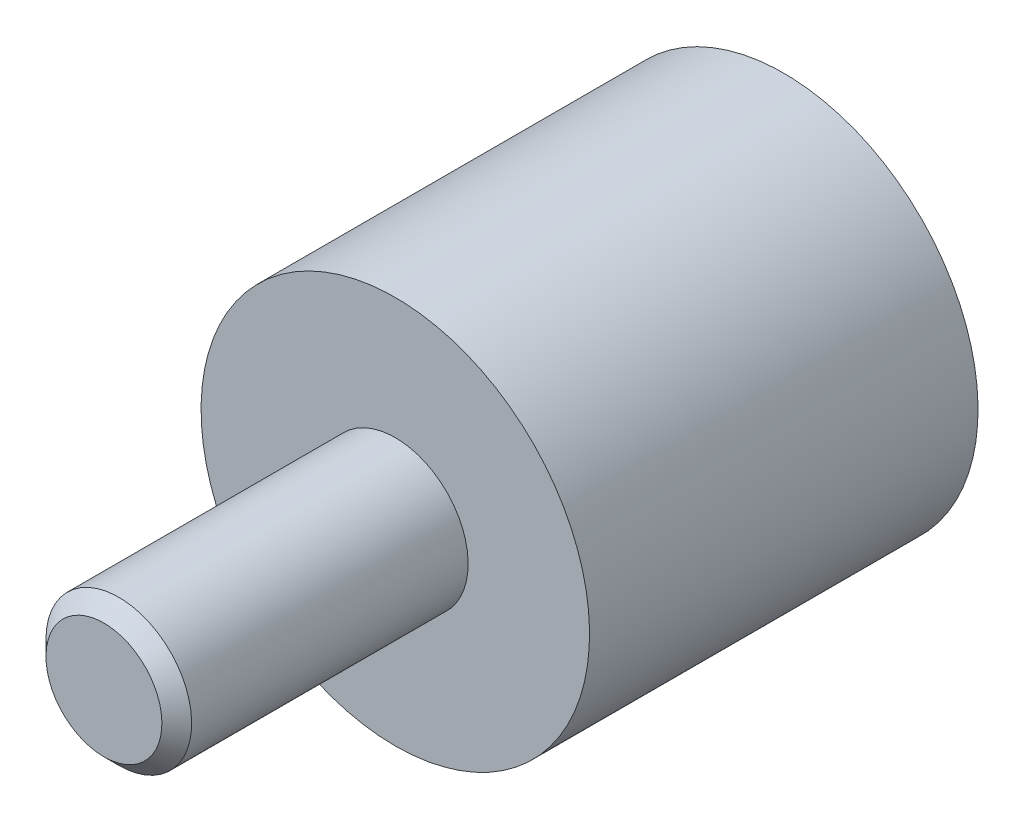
ISO-10303-21;
HEADER;
FILE_DESCRIPTION(('STEP AP214'),'2;1');
FILE_NAME('part.step','',(''),(''),'','','');
FILE_SCHEMA(('AUTOMOTIVE_DESIGN { 1 0 10303 214 1 1 1 1 }'));
ENDSEC;
DATA;
#1=APPLICATION_CONTEXT('core data for automotive mechanical design processes');
#2=APPLICATION_PROTOCOL_DEFINITION('international standard','automotive_design',2000,#1);
#3=PRODUCT_CONTEXT('',#1,'mechanical');
#4=PRODUCT('Part','Part','',(#3));
#5=PRODUCT_RELATED_PRODUCT_CATEGORY('part','',(#4));
#6=PRODUCT_DEFINITION_FORMATION('','',#4);
#7=PRODUCT_DEFINITION_CONTEXT('part definition',#1,'design');
#8=PRODUCT_DEFINITION('design','',#6,#7);
#9=PRODUCT_DEFINITION_SHAPE('','',#8);
#10=(LENGTH_UNIT() NAMED_UNIT(*) SI_UNIT(.MILLI.,.METRE.));
#11=(NAMED_UNIT(*) PLANE_ANGLE_UNIT() SI_UNIT($,.RADIAN.));
#12=(NAMED_UNIT(*) SI_UNIT($,.STERADIAN.) SOLID_ANGLE_UNIT());
#13=UNCERTAINTY_MEASURE_WITH_UNIT(LENGTH_MEASURE(1.E-05),#10,'distance_accuracy_value','');
#14=(GEOMETRIC_REPRESENTATION_CONTEXT(3) GLOBAL_UNCERTAINTY_ASSIGNED_CONTEXT((#13)) GLOBAL_UNIT_ASSIGNED_CONTEXT((#10,
#11,#12)) REPRESENTATION_CONTEXT('',''));
#15=CARTESIAN_POINT('',(0.,0.,0.));
#16=DIRECTION('',(0.,0.,1.));
#17=DIRECTION('',(1.,0.,0.));
#18=AXIS2_PLACEMENT_3D('',#15,#16,#17);
#19=CARTESIAN_POINT('',(3.7333333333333,0.,8.));
#20=DIRECTION('',(0.,0.,1.));
#21=DIRECTION('',(0.,-1.,0.));
#22=AXIS2_PLACEMENT_3D('',#19,#20,#21);
#23=PLANE('',#22);
#24=CARTESIAN_POINT('',(0.,0.,8.));
#25=DIRECTION('',(0.,0.,1.));
#26=DIRECTION('',(0.,-1.,0.));
#27=AXIS2_PLACEMENT_3D('',#24,#25,#26);
#28=CIRCLE('',#27,1.5);
#29=CARTESIAN_POINT('',(0.,-1.5,8.));
#30=VERTEX_POINT('',#29);
#31=EDGE_CURVE('E23',#30,#30,#28,.T.);
#32=ORIENTED_EDGE('',*,*,#31,.F.);
#33=EDGE_LOOP('',(#32));
#34=FACE_BOUND('',#33,.T.);
#35=CARTESIAN_POINT('',(0.,0.,8.));
#36=DIRECTION('',(0.,0.,1.));
#37=DIRECTION('',(0.,-1.,0.));
#38=AXIS2_PLACEMENT_3D('',#35,#36,#37);
#39=CIRCLE('',#38,4.);
#40=CARTESIAN_POINT('',(0.,-4.,8.));
#41=VERTEX_POINT('',#40);
#42=EDGE_CURVE('E27',#41,#41,#39,.T.);
#43=ORIENTED_EDGE('',*,*,#42,.T.);
#44=EDGE_LOOP('',(#43));
#45=FACE_BOUND('',#44,.T.);
#46=ADVANCED_FACE('F12',(#34,#45),#23,.T.);
#47=CARTESIAN_POINT('',(0.,0.,0.26666666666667));
#48=DIRECTION('',(0.,0.,1.));
#49=DIRECTION('',(0.,-1.,0.));
#50=AXIS2_PLACEMENT_3D('',#47,#48,#49);
#51=CYLINDRICAL_SURFACE('',#50,4.);
#52=CARTESIAN_POINT('',(0.,0.,0.));
#53=DIRECTION('',(0.,0.,1.));
#54=DIRECTION('',(0.,-1.,0.));
#55=AXIS2_PLACEMENT_3D('',#52,#53,#54);
#56=CIRCLE('',#55,4.);
#57=CARTESIAN_POINT('',(0.,-4.,0.));
#58=VERTEX_POINT('',#57);
#59=EDGE_CURVE('E32',#58,#58,#56,.T.);
#60=ORIENTED_EDGE('',*,*,#59,.T.);
#61=EDGE_LOOP('',(#60));
#62=FACE_BOUND('',#61,.T.);
#63=ORIENTED_EDGE('',*,*,#42,.F.);
#64=EDGE_LOOP('',(#63));
#65=FACE_BOUND('',#64,.T.);
#66=ADVANCED_FACE('F63',(#62,#65),#51,.T.);
#67=CARTESIAN_POINT('',(4.,0.,0.));
#68=DIRECTION('',(0.,0.,-1.));
#69=DIRECTION('',(0.,1.,0.));
#70=AXIS2_PLACEMENT_3D('',#67,#68,#69);
#71=PLANE('',#70);
#72=CARTESIAN_POINT('',(0.,0.,0.));
#73=DIRECTION('',(0.,0.,-1.));
#74=DIRECTION('',(0.,1.,0.));
#75=AXIS2_PLACEMENT_3D('',#72,#73,#74);
#76=CIRCLE('',#75,1.8);
#77=CARTESIAN_POINT('',(0.,1.8,0.));
#78=VERTEX_POINT('',#77);
#79=EDGE_CURVE('E8',#78,#78,#76,.F.);
#80=ORIENTED_EDGE('',*,*,#79,.T.);
#81=EDGE_LOOP('',(#80));
#82=FACE_BOUND('',#81,.T.);
#83=ORIENTED_EDGE('',*,*,#59,.F.);
#84=EDGE_LOOP('',(#83));
#85=FACE_BOUND('',#84,.T.);
#86=ADVANCED_FACE('F68',(#82,#85),#71,.T.);
#87=CARTESIAN_POINT('',(0.,0.,14.));
#88=DIRECTION('',(0.,0.,1.));
#89=DIRECTION('',(0.,-1.,0.));
#90=AXIS2_PLACEMENT_3D('',#87,#88,#89);
#91=PLANE('',#90);
#92=CARTESIAN_POINT('',(0.,0.,14.));
#93=DIRECTION('',(0.,0.,1.));
#94=DIRECTION('',(0.,-1.,0.));
#95=AXIS2_PLACEMENT_3D('',#92,#93,#94);
#96=CIRCLE('',#95,1.1935);
#97=CARTESIAN_POINT('',(0.,-1.1935,14.));
#98=VERTEX_POINT('',#97);
#99=EDGE_CURVE('E35',#98,#98,#96,.T.);
#100=ORIENTED_EDGE('',*,*,#99,.T.);
#101=EDGE_LOOP('',(#100));
#102=FACE_BOUND('',#101,.T.);
#103=ADVANCED_FACE('F74',(#102),#91,.T.);
#104=CARTESIAN_POINT('',(0.,0.,14.));
#105=DIRECTION('',(0.,0.,-1.));
#106=DIRECTION('',(0.,1.,0.));
#107=AXIS2_PLACEMENT_3D('',#104,#105,#106);
#108=CONICAL_SURFACE('',#107,1.1935,0.785398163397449);
#109=CARTESIAN_POINT('',(0.,0.,13.6935));
#110=DIRECTION('',(0.,0.,1.));
#111=DIRECTION('',(0.,-1.,0.));
#112=AXIS2_PLACEMENT_3D('',#109,#110,#111);
#113=CIRCLE('',#112,1.5);
#114=CARTESIAN_POINT('',(0.,-1.5,13.6935));
#115=VERTEX_POINT('',#114);
#116=EDGE_CURVE('E38',#115,#115,#113,.T.);
#117=ORIENTED_EDGE('',*,*,#116,.T.);
#118=EDGE_LOOP('',(#117));
#119=FACE_BOUND('',#118,.T.);
#120=ORIENTED_EDGE('',*,*,#99,.F.);
#121=EDGE_LOOP('',(#120));
#122=FACE_BOUND('',#121,.T.);
#123=ADVANCED_FACE('F57',(#119,#122),#108,.T.);
#124=CARTESIAN_POINT('',(0.,0.,8.));
#125=DIRECTION('',(0.,0.,1.));
#126=DIRECTION('',(0.,-1.,0.));
#127=AXIS2_PLACEMENT_3D('',#124,#125,#126);
#128=CYLINDRICAL_SURFACE('',#127,1.5);
#129=ORIENTED_EDGE('',*,*,#31,.T.);
#130=EDGE_LOOP('',(#129));
#131=FACE_BOUND('',#130,.T.);
#132=ORIENTED_EDGE('',*,*,#116,.F.);
#133=EDGE_LOOP('',(#132));
#134=FACE_BOUND('',#133,.T.);
#135=ADVANCED_FACE('F49',(#131,#134),#128,.T.);
#136=CARTESIAN_POINT('',(0.,0.,0.));
#137=DIRECTION('',(0.,0.,1.));
#138=DIRECTION('',(0.,-1.,0.));
#139=AXIS2_PLACEMENT_3D('',#136,#137,#138);
#140=CYLINDRICAL_SURFACE('',#139,1.5);
#141=CARTESIAN_POINT('',(0.,0.,0.3));
#142=DIRECTION('',(0.,0.,-1.));
#143=DIRECTION('',(0.,1.,0.));
#144=AXIS2_PLACEMENT_3D('',#141,#142,#143);
#145=CIRCLE('',#144,1.5);
#146=CARTESIAN_POINT('',(0.,1.5,0.3));
#147=VERTEX_POINT('',#146);
#148=EDGE_CURVE('E19',#147,#147,#145,.T.);
#149=ORIENTED_EDGE('',*,*,#148,.T.);
#150=EDGE_LOOP('',(#149));
#151=FACE_BOUND('',#150,.T.);
#152=CARTESIAN_POINT('',(0.,0.,3.));
#153=DIRECTION('',(0.,0.,-1.));
#154=DIRECTION('',(0.,1.,0.));
#155=AXIS2_PLACEMENT_3D('',#152,#153,#154);
#156=CIRCLE('',#155,1.5);
#157=CARTESIAN_POINT('',(0.,1.5,3.));
#158=VERTEX_POINT('',#157);
#159=EDGE_CURVE('E41',#158,#158,#156,.T.);
#160=ORIENTED_EDGE('',*,*,#159,.F.);
#161=EDGE_LOOP('',(#160));
#162=FACE_BOUND('',#161,.T.);
#163=ADVANCED_FACE('F47',(#151,#162),#140,.F.);
#164=CARTESIAN_POINT('',(0.,0.,3.));
#165=DIRECTION('',(0.,0.,-1.));
#166=DIRECTION('',(0.,1.,0.));
#167=AXIS2_PLACEMENT_3D('',#164,#165,#166);
#168=PLANE('',#167);
#169=ORIENTED_EDGE('',*,*,#159,.T.);
#170=EDGE_LOOP('',(#169));
#171=FACE_BOUND('',#170,.T.);
#172=ADVANCED_FACE('F45',(#171),#168,.T.);
#173=CARTESIAN_POINT('',(0.,0.,0.3));
#174=DIRECTION('',(0.,0.,-1.));
#175=DIRECTION('',(0.,1.,0.));
#176=AXIS2_PLACEMENT_3D('',#173,#174,#175);
#177=CONICAL_SURFACE('',#176,1.5,0.785398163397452);
#178=ORIENTED_EDGE('',*,*,#79,.F.);
#179=EDGE_LOOP('',(#178));
#180=FACE_BOUND('',#179,.T.);
#181=ORIENTED_EDGE('',*,*,#148,.F.);
#182=EDGE_LOOP('',(#181));
#183=FACE_BOUND('',#182,.T.);
#184=ADVANCED_FACE('F14',(#180,#183),#177,.F.);
#185=CLOSED_SHELL('',(#46,#66,#86,#103,#123,#135,#163,#172,#184));
#186=MANIFOLD_SOLID_BREP('B1',#185);
#187=ADVANCED_BREP_SHAPE_REPRESENTATION('',(#18,#186),#14);
#188=SHAPE_DEFINITION_REPRESENTATION(#9,#187);
ENDSEC;
END-ISO-10303-21;
